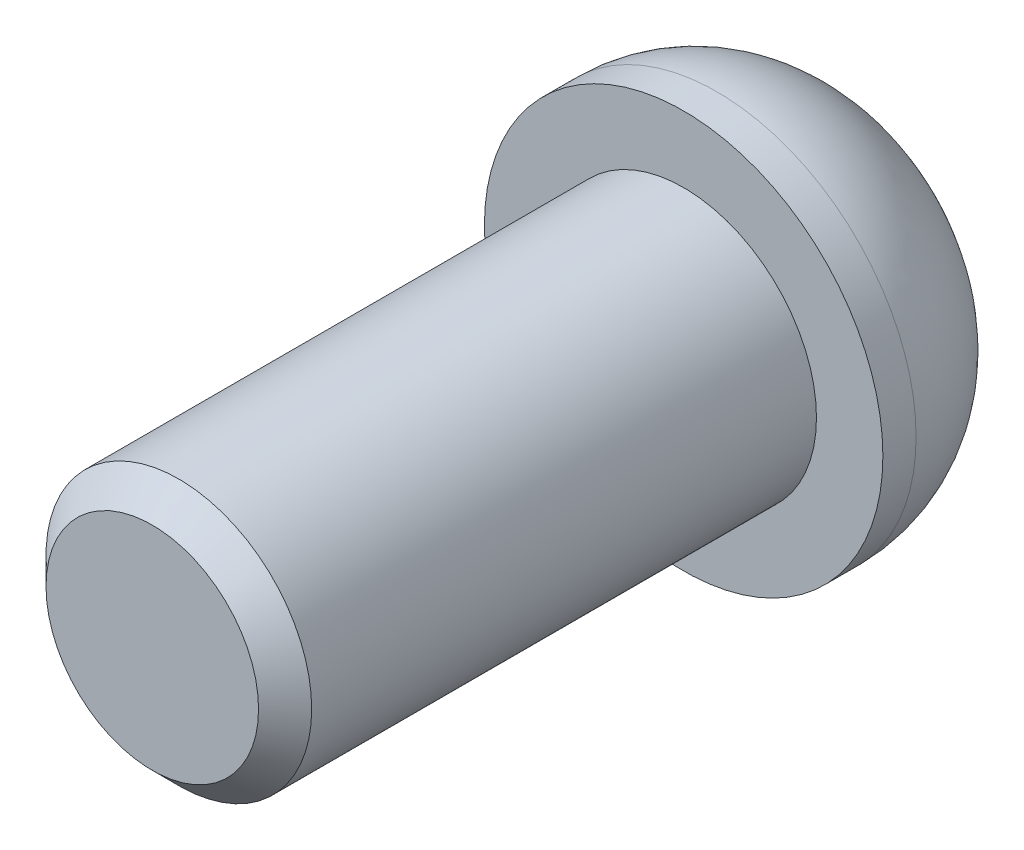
ISO-10303-21;
HEADER;
FILE_DESCRIPTION(('STEP AP214'),'2;1');
FILE_NAME('part.step','',(''),(''),'','','');
FILE_SCHEMA(('AUTOMOTIVE_DESIGN { 1 0 10303 214 1 1 1 1 }'));
ENDSEC;
DATA;
#1=APPLICATION_CONTEXT('core data for automotive mechanical design processes');
#2=APPLICATION_PROTOCOL_DEFINITION('international standard','automotive_design',2000,#1);
#3=PRODUCT_CONTEXT('',#1,'mechanical');
#4=PRODUCT('Part','Part','',(#3));
#5=PRODUCT_RELATED_PRODUCT_CATEGORY('part','',(#4));
#6=PRODUCT_DEFINITION_FORMATION('','',#4);
#7=PRODUCT_DEFINITION_CONTEXT('part definition',#1,'design');
#8=PRODUCT_DEFINITION('design','',#6,#7);
#9=PRODUCT_DEFINITION_SHAPE('','',#8);
#10=(LENGTH_UNIT() NAMED_UNIT(*) SI_UNIT(.MILLI.,.METRE.));
#11=(NAMED_UNIT(*) PLANE_ANGLE_UNIT() SI_UNIT($,.RADIAN.));
#12=(NAMED_UNIT(*) SI_UNIT($,.STERADIAN.) SOLID_ANGLE_UNIT());
#13=UNCERTAINTY_MEASURE_WITH_UNIT(LENGTH_MEASURE(1.E-05),#10,'distance_accuracy_value','');
#14=(GEOMETRIC_REPRESENTATION_CONTEXT(3) GLOBAL_UNCERTAINTY_ASSIGNED_CONTEXT((#13)) GLOBAL_UNIT_ASSIGNED_CONTEXT((#10,
#11,#12)) REPRESENTATION_CONTEXT('',''));
#15=CARTESIAN_POINT('',(0.,0.,0.));
#16=DIRECTION('',(0.,0.,1.));
#17=DIRECTION('',(1.,0.,0.));
#18=AXIS2_PLACEMENT_3D('',#15,#16,#17);
#19=CARTESIAN_POINT('',(0.,0.,-1.));
#20=DIRECTION('',(0.,0.,-1.));
#21=DIRECTION('',(-1.,0.,0.));
#22=AXIS2_PLACEMENT_3D('',#19,#20,#21);
#23=DEGENERATE_TOROIDAL_SURFACE('',#22,1.5,4.5,.T.);
#24=CARTESIAN_POINT('',(0.,0.,-1.));
#25=DIRECTION('',(0.,0.,-1.));
#26=DIRECTION('',(-1.,0.,0.));
#27=AXIS2_PLACEMENT_3D('',#24,#25,#26);
#28=CIRCLE('',#27,6.);
#29=CARTESIAN_POINT('',(-6.,0.,-1.));
#30=VERTEX_POINT('',#29);
#31=EDGE_CURVE('E104',#30,#30,#28,.T.);
#32=ORIENTED_EDGE('',*,*,#31,.T.);
#33=EDGE_LOOP('',(#32));
#34=FACE_BOUND('',#33,.T.);
#35=CARTESIAN_POINT('',(-3.,0.,-5.24264068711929));
#36=CARTESIAN_POINT('',(-3.,0.106235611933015,-5.24263949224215));
#37=CARTESIAN_POINT('',(-3.,0.212466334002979,-5.24065218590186));
#38=CARTESIAN_POINT('',(-3.,0.424775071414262,-5.23262299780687));
#39=CARTESIAN_POINT('',(-3.,0.530853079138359,-5.22658092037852));
#40=CARTESIAN_POINT('',(-3.,0.848689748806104,-5.20207775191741));
#41=CARTESIAN_POINT('',(-3.,1.06001518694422,-5.17723961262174));
#42=CARTESIAN_POINT('',(-3.,1.47852757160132,-5.10800809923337));
#43=CARTESIAN_POINT('',(-3.,1.68572886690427,-5.06370327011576));
#44=CARTESIAN_POINT('',(-3.,2.09397220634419,-4.95262336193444));
#45=CARTESIAN_POINT('',(-3.,2.29502078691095,-4.88587310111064));
#46=CARTESIAN_POINT('',(-3.,2.60616926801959,-4.76060307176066));
#47=CARTESIAN_POINT('',(-3.,2.71952529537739,-4.71007776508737));
#48=CARTESIAN_POINT('',(-3.,2.94201444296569,-4.60043007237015));
#49=CARTESIAN_POINT('',(-3.,3.05114801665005,-4.54130861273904));
#50=CARTESIAN_POINT('',(-3.,3.26430134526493,-4.41442738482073));
#51=CARTESIAN_POINT('',(-3.,3.36832042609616,-4.3466664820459));
#52=CARTESIAN_POINT('',(-3.,3.57031812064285,-4.20265018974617));
#53=CARTESIAN_POINT('',(-3.,3.66829662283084,-4.12639464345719));
#54=CARTESIAN_POINT('',(-3.,3.85774604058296,-3.9653126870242));
#55=CARTESIAN_POINT('',(-3.,3.94918406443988,-3.88044752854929));
#56=CARTESIAN_POINT('',(-3.,4.12418125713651,-3.70287619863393));
#57=CARTESIAN_POINT('',(-3.,4.2077374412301,-3.61016708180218));
#58=CARTESIAN_POINT('',(-3.,4.36606006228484,-3.41757723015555));
#59=CARTESIAN_POINT('',(-3.,4.44082980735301,-3.31769921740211));
#60=CARTESIAN_POINT('',(-3.,4.5808709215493,-3.11143338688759));
#61=CARTESIAN_POINT('',(-3.,4.64613902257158,-3.00504334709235));
#62=CARTESIAN_POINT('',(-3.,4.76237670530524,-2.79404402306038));
#63=CARTESIAN_POINT('',(-3.,4.81401568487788,-2.68980302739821));
#64=CARTESIAN_POINT('',(-3.,4.90795864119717,-2.47714833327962));
#65=CARTESIAN_POINT('',(-3.,4.95025923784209,-2.36873314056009));
#66=CARTESIAN_POINT('',(-3.,5.02507846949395,-2.14864951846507));
#67=CARTESIAN_POINT('',(-3.,5.05760363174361,-2.03698331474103));
#68=CARTESIAN_POINT('',(-3.,5.11261717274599,-1.81119389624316));
#69=CARTESIAN_POINT('',(-3.,5.13510193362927,-1.69706981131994));
#70=CARTESIAN_POINT('',(-3.,5.1855293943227,-1.36286611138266));
#71=CARTESIAN_POINT('',(-3.,5.1999223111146,-1.14057767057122));
#72=CARTESIAN_POINT('',(-3.,5.19068849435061,-0.696926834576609));
#73=CARTESIAN_POINT('',(-3.,5.16706539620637,-0.475564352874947));
#74=CARTESIAN_POINT('',(-3.,5.08315277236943,-0.0425431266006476));
#75=CARTESIAN_POINT('',(-3.,5.02328901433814,0.169198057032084));
#76=CARTESIAN_POINT('',(-3.,4.86926580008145,0.57976055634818));
#77=CARTESIAN_POINT('',(-3.,4.7751091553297,0.778582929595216));
#78=CARTESIAN_POINT('',(-3.,4.55430118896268,1.16039899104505));
#79=CARTESIAN_POINT('',(-3.,4.42727866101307,1.34317762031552));
#80=CARTESIAN_POINT('',(-3.,4.14543120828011,1.68588944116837));
#81=CARTESIAN_POINT('',(-3.,3.99059590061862,1.8458140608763));
#82=CARTESIAN_POINT('',(-3.,3.65104925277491,2.14580620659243));
#83=CARTESIAN_POINT('',(-3.,3.46535730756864,2.2847597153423));
#84=CARTESIAN_POINT('',(-3.,3.0751909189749,2.53254712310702));
#85=CARTESIAN_POINT('',(-3.,2.87073222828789,2.64140598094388));
#86=CARTESIAN_POINT('',(-3.,2.51303879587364,2.80083705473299));
#87=CARTESIAN_POINT('',(-3.,2.36312749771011,2.85906808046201));
#88=CARTESIAN_POINT('',(-3.,2.05866247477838,2.96191606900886));
#89=CARTESIAN_POINT('',(-3.,1.90410728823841,3.00652869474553));
#90=CARTESIAN_POINT('',(-3.,1.59113761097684,3.08335556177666));
#91=CARTESIAN_POINT('',(-3.,1.43270714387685,3.11550362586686));
#92=CARTESIAN_POINT('',(-3.,1.1139659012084,3.16839749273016));
#93=CARTESIAN_POINT('',(-3.,0.953654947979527,3.18914220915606));
#94=CARTESIAN_POINT('',(-3.,0.68108593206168,3.21569206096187));
#95=CARTESIAN_POINT('',(-3.,0.569070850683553,3.22412335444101));
#96=CARTESIAN_POINT('',(-3.,0.344778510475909,3.23637578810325));
#97=CARTESIAN_POINT('',(-3.,0.23250123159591,3.24019656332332));
#98=CARTESIAN_POINT('',(-3.,0.00781434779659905,3.2433824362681));
#99=CARTESIAN_POINT('',(-3.,-0.104595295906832,3.24274471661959));
#100=CARTESIAN_POINT('',(-3.,-0.329298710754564,3.23698082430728));
#101=CARTESIAN_POINT('',(-3.,-0.441592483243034,3.23185470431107));
#102=CARTESIAN_POINT('',(-3.,-0.66547675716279,3.21693634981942));
#103=CARTESIAN_POINT('',(-3.,-0.777068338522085,3.20716081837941));
#104=CARTESIAN_POINT('',(-3.,-0.999700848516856,3.18261749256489));
#105=CARTESIAN_POINT('',(-3.,-1.11074170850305,3.16784909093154));
#106=CARTESIAN_POINT('',(-3.,-1.44236615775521,3.11544322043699));
#107=CARTESIAN_POINT('',(-3.,-1.66179295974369,3.06968493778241));
#108=CARTESIAN_POINT('',(-3.,-2.00610733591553,2.97682275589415));
#109=CARTESIAN_POINT('',(-3.,-2.13321212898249,2.93780607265));
#110=CARTESIAN_POINT('',(-3.,-2.38414729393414,2.85039235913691));
#111=CARTESIAN_POINT('',(-3.,-2.50797865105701,2.80199818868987));
#112=CARTESIAN_POINT('',(-3.,-2.75125299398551,2.69551015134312));
#113=CARTESIAN_POINT('',(-3.,-2.87070059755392,2.63742687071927));
#114=CARTESIAN_POINT('',(-3.,-3.10427715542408,2.51136880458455));
#115=CARTESIAN_POINT('',(-3.,-3.21840607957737,2.44339396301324));
#116=CARTESIAN_POINT('',(-3.,-3.44110072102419,2.29704687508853));
#117=CARTESIAN_POINT('',(-3.,-3.54961548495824,2.21859688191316));
#118=CARTESIAN_POINT('',(-3.,-3.75894467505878,2.05202253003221));
#119=CARTESIAN_POINT('',(-3.,-3.8597598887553,1.96389916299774));
#120=CARTESIAN_POINT('',(-3.,-4.05263576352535,1.77842866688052));
#121=CARTESIAN_POINT('',(-3.,-4.1446915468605,1.68107645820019));
#122=CARTESIAN_POINT('',(-3.,-4.31891815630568,1.47789786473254));
#123=CARTESIAN_POINT('',(-3.,-4.40109010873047,1.3720724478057));
#124=CARTESIAN_POINT('',(-3.,-4.54643438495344,1.16446650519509));
#125=CARTESIAN_POINT('',(-3.,-4.61069753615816,1.06344804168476));
#126=CARTESIAN_POINT('',(-3.,-4.72996144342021,0.856033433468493));
#127=CARTESIAN_POINT('',(-3.,-4.78495913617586,0.749635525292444));
#128=CARTESIAN_POINT('',(-3.,-4.88507638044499,0.532403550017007));
#129=CARTESIAN_POINT('',(-3.,-4.93020545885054,0.421573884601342));
#130=CARTESIAN_POINT('',(-3.,-5.01022120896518,0.196265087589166));
#131=CARTESIAN_POINT('',(-3.,-5.04510424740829,0.0817846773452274));
#132=CARTESIAN_POINT('',(-3.,-5.13001100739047,-0.250893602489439));
#133=CARTESIAN_POINT('',(-3.,-5.16678689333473,-0.472639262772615));
#134=CARTESIAN_POINT('',(-3.,-5.20174368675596,-0.91902341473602));
#135=CARTESIAN_POINT('',(-3.,-5.1999290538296,-1.14366156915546));
#136=CARTESIAN_POINT('',(-3.,-5.15825140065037,-1.58495021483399));
#137=CARTESIAN_POINT('',(-3.,-5.11913344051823,-1.80167099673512));
#138=CARTESIAN_POINT('',(-3.,-5.00524104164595,-2.22549681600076));
#139=CARTESIAN_POINT('',(-3.,-4.93046840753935,-2.43260233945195));
#140=CARTESIAN_POINT('',(-3.,-4.74728289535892,-2.83264502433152));
#141=CARTESIAN_POINT('',(-3.,-4.63869596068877,-3.02550233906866));
#142=CARTESIAN_POINT('',(-3.,-4.39160310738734,-3.39093989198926));
#143=CARTESIAN_POINT('',(-3.,-4.25309491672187,-3.56351858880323));
#144=CARTESIAN_POINT('',(-3.,-3.94582464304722,-3.88962572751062));
#145=CARTESIAN_POINT('',(-3.,-3.77624930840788,-4.04238605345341));
#146=CARTESIAN_POINT('',(-3.,-3.41546125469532,-4.31960240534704));
#147=CARTESIAN_POINT('',(-3.,-3.22424507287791,-4.44405389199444));
#148=CARTESIAN_POINT('',(-3.,-2.81019497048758,-4.67239316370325));
#149=CARTESIAN_POINT('',(-3.,-2.58605749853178,-4.77390276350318));
#150=CARTESIAN_POINT('',(-3.,-2.12599927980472,-4.94433820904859));
#151=CARTESIAN_POINT('',(-3.,-1.89007882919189,-5.01326487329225));
#152=CARTESIAN_POINT('',(-3.,-1.3810647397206,-5.12939698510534));
#153=CARTESIAN_POINT('',(-3.,-1.10709195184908,-5.17266971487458));
#154=CARTESIAN_POINT('',(-3.,-0.693632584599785,-5.21508446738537));
#155=CARTESIAN_POINT('',(-3.,-0.555119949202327,-5.2254717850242));
#156=CARTESIAN_POINT('',(-3.,-0.27773540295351,-5.23925037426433));
#157=CARTESIAN_POINT('',(-3.,-0.138863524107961,-5.24264224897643));
#158=CARTESIAN_POINT('',(-3.,0.,-5.24264068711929));
#159=B_SPLINE_CURVE_WITH_KNOTS('',3,(#35,#36,#37,#38,#39,#40,#41,#42,#43,#44,#45,#46,#47,#48,
#49,#50,#51,#52,#53,#54,#55,#56,#57,#58,#59,#60,#61,#62,#63,#64,#65,#66,#67,#68,#69,#70,#71,#72,
#73,#74,#75,#76,#77,#78,#79,#80,#81,#82,#83,#84,#85,#86,#87,#88,#89,#90,#91,#92,#93,#94,#95,#96,
#97,#98,#99,#100,#101,#102,#103,#104,#105,#106,#107,#108,#109,#110,#111,#112,#113,#114,#115,
#116,#117,#118,#119,#120,#121,#122,#123,#124,#125,#126,#127,#128,#129,#130,#131,#132,#133,#134,
#135,#136,#137,#138,#139,#140,#141,#142,#143,#144,#145,#146,#147,#148,#149,#150,#151,#152,#153,
#154,#155,#156,#157,#158),.UNSPECIFIED.,.T.,.F.,(4,2,2,2,2,2,2,2,2,2,2,2,2,2,2,2,2,2,2,2,2,2,2,
2,2,2,2,2,2,2,2,2,2,2,2,2,2,2,2,2,2,2,2,2,2,2,2,2,2,2,2,2,2,2,2,2,2,2,2,2,2,4),(0.,
0.318674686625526,0.637364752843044,1.2748522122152,1.90946957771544,2.54338753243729,
2.91538752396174,3.28734745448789,3.65935627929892,4.03137197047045,4.4051432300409,
4.7790554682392,5.15282647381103,5.52672573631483,5.87527563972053,6.22395149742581,
6.57239401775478,6.92096199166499,7.58571138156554,8.25039720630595,8.90742164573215,
9.56439223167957,10.2291341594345,10.8941247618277,11.5870032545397,12.2793053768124,
12.7611450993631,13.2431381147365,13.727656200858,14.2122204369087,14.5491272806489,
14.8860607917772,15.2232072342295,15.5603497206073,15.8962900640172,16.2322712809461,
16.9032115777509,17.3017800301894,17.7002271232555,18.0982416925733,18.4962585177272,
18.8974132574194,19.2985269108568,19.6998626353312,20.1011525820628,20.4598672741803,
20.8187003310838,21.1771854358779,21.535797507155,22.2065378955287,22.8772007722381,
23.5347430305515,24.1922520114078,24.853203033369,25.514204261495,26.1959561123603,
26.8778172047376,27.6131539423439,28.3484722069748,29.1783423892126,29.5949268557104,
30.0114754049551),.UNSPECIFIED.);
#160=CARTESIAN_POINT('',(-3.,-1.73205080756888,-5.04874114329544));
#161=VERTEX_POINT('',#160);
#162=CARTESIAN_POINT('',(-3.,1.73205080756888,-5.04874114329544));
#163=VERTEX_POINT('',#162);
#164=EDGE_CURVE('E177',#161,#163,#159,.T.);
#165=ORIENTED_EDGE('',*,*,#164,.F.);
#166=CARTESIAN_POINT('',(0.000199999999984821,-3.4642170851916,-5.04868512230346));
#167=CARTESIAN_POINT('',(-0.0880572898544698,-3.41326171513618,-5.07340804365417));
#168=CARTESIAN_POINT('',(-0.176855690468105,-3.36199393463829,-5.09545850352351));
#169=CARTESIAN_POINT('',(-0.355238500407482,-3.25900457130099,-5.1345672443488));
#170=CARTESIAN_POINT('',(-0.444822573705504,-3.20728318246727,-5.15162756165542));
#171=CARTESIAN_POINT('',(-0.624544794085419,-3.10352051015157,-5.18112701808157));
#172=CARTESIAN_POINT('',(-0.71468288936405,-3.05147925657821,-5.19356658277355));
#173=CARTESIAN_POINT('',(-0.89532970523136,-2.94718276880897,-5.21415032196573));
#174=CARTESIAN_POINT('',(-0.985838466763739,-2.89492751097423,-5.22229400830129));
#175=CARTESIAN_POINT('',(-1.25438139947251,-2.73988417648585,-5.24047876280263));
#176=CARTESIAN_POINT('',(-1.43272157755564,-2.63691942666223,-5.24478751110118));
#177=CARTESIAN_POINT('',(-1.78918301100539,-2.4311163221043,-5.23855836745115));
#178=CARTESIAN_POINT('',(-1.96730430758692,-2.32827794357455,-5.2280239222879));
#179=CARTESIAN_POINT('',(-2.21649805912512,-2.18440586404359,-5.20181563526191));
#180=CARTESIAN_POINT('',(-2.28812943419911,-2.1430494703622,-5.19294194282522));
#181=CARTESIAN_POINT('',(-2.43106610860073,-2.06052494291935,-5.17236840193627));
#182=CARTESIAN_POINT('',(-2.50237151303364,-2.01935674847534,-5.16066954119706));
#183=CARTESIAN_POINT('',(-2.64508448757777,-1.93696137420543,-5.1341775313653));
#184=CARTESIAN_POINT('',(-2.71648902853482,-1.89573594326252,-5.11936249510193));
#185=CARTESIAN_POINT('',(-2.85877926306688,-1.81358463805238,-5.08649691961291));
#186=CARTESIAN_POINT('',(-2.92966463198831,-1.77265895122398,-5.06844451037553));
#187=CARTESIAN_POINT('',(-3.0002,-1.73193533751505,-5.04868512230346));
#188=B_SPLINE_CURVE_WITH_KNOTS('',3,(#166,#167,#168,#169,#170,#171,#172,#173,#174,#175,#176,
#177,#178,#179,#180,#181,#182,#183,#184,#185,#186,#187),.UNSPECIFIED.,.F.,.F.,(4,2,2,2,2,2,2,2,
2,2,4),(0.,0.314530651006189,0.628932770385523,0.943305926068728,1.2577147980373,
1.87506574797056,2.49227336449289,2.74179737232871,2.99123426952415,3.24248542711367,
3.49388218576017),.UNSPECIFIED.);
#189=CARTESIAN_POINT('',(0.,-3.46410161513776,-5.04874114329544));
#190=VERTEX_POINT('',#189);
#191=EDGE_CURVE('E141',#190,#161,#188,.T.);
#192=ORIENTED_EDGE('',*,*,#191,.F.);
#193=CARTESIAN_POINT('',(3.0002,-1.73193533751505,-5.04868512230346));
#194=CARTESIAN_POINT('',(2.91194271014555,-1.78289070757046,-5.07340804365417));
#195=CARTESIAN_POINT('',(2.82314430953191,-1.83415848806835,-5.09545850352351));
#196=CARTESIAN_POINT('',(2.64476149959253,-1.93714785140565,-5.1345672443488));
#197=CARTESIAN_POINT('',(2.55517742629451,-1.98886924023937,-5.15162756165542));
#198=CARTESIAN_POINT('',(2.3754552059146,-2.09263191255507,-5.18112701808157));
#199=CARTESIAN_POINT('',(2.28531711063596,-2.14467316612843,-5.19356658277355));
#200=CARTESIAN_POINT('',(2.10467029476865,-2.24896965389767,-5.21415032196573));
#201=CARTESIAN_POINT('',(2.01416153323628,-2.30122491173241,-5.22229400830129));
#202=CARTESIAN_POINT('',(1.74561860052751,-2.45626824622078,-5.24047876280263));
#203=CARTESIAN_POINT('',(1.56727842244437,-2.55923299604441,-5.24478751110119));
#204=CARTESIAN_POINT('',(1.21081698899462,-2.76503610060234,-5.23855836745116));
#205=CARTESIAN_POINT('',(1.03269569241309,-2.86787447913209,-5.2280239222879));
#206=CARTESIAN_POINT('',(0.783501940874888,-3.01174655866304,-5.20181563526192));
#207=CARTESIAN_POINT('',(0.711870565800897,-3.05310295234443,-5.19294194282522));
#208=CARTESIAN_POINT('',(0.568933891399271,-3.13562747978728,-5.17236840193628));
#209=CARTESIAN_POINT('',(0.497628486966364,-3.1767956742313,-5.16066954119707));
#210=CARTESIAN_POINT('',(0.354915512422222,-3.25919104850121,-5.13417753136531));
#211=CARTESIAN_POINT('',(0.283510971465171,-3.30041647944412,-5.11936249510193));
#212=CARTESIAN_POINT('',(0.141220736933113,-3.38256778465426,-5.08649691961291));
#213=CARTESIAN_POINT('',(0.0703353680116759,-3.42349347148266,-5.06844451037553));
#214=CARTESIAN_POINT('',(-0.000200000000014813,-3.4642170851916,-5.04868512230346));
#215=B_SPLINE_CURVE_WITH_KNOTS('',3,(#193,#194,#195,#196,#197,#198,#199,#200,#201,#202,#203,
#204,#205,#206,#207,#208,#209,#210,#211,#212,#213,#214),.UNSPECIFIED.,.F.,.F.,(4,2,2,2,2,2,2,2,
2,2,4),(0.,0.314530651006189,0.628932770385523,0.943305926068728,1.2577147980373,
1.87506574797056,2.49227336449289,2.74179737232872,2.99123426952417,3.24248542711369,
3.4938821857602),.UNSPECIFIED.);
#216=CARTESIAN_POINT('',(3.,-1.73205080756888,-5.04874114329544));
#217=VERTEX_POINT('',#216);
#218=EDGE_CURVE('E117',#217,#190,#215,.T.);
#219=ORIENTED_EDGE('',*,*,#218,.F.);
#220=CARTESIAN_POINT('',(3.,0.,-5.24264068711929));
#221=CARTESIAN_POINT('',(3.,-0.106235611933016,-5.24263949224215));
#222=CARTESIAN_POINT('',(3.,-0.21246633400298,-5.24065218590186));
#223=CARTESIAN_POINT('',(3.,-0.424775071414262,-5.23262299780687));
#224=CARTESIAN_POINT('',(3.,-0.53085307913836,-5.22658092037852));
#225=CARTESIAN_POINT('',(3.,-0.848689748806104,-5.20207775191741));
#226=CARTESIAN_POINT('',(3.,-1.06001518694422,-5.17723961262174));
#227=CARTESIAN_POINT('',(3.,-1.47852757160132,-5.10800809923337));
#228=CARTESIAN_POINT('',(3.,-1.68572886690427,-5.06370327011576));
#229=CARTESIAN_POINT('',(3.,-2.09397220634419,-4.95262336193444));
#230=CARTESIAN_POINT('',(3.,-2.29502078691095,-4.88587310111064));
#231=CARTESIAN_POINT('',(3.,-2.60616926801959,-4.76060307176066));
#232=CARTESIAN_POINT('',(3.,-2.71952529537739,-4.71007776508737));
#233=CARTESIAN_POINT('',(3.,-2.94201444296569,-4.60043007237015));
#234=CARTESIAN_POINT('',(3.,-3.05114801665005,-4.54130861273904));
#235=CARTESIAN_POINT('',(3.,-3.26430134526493,-4.41442738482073));
#236=CARTESIAN_POINT('',(3.,-3.36832042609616,-4.3466664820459));
#237=CARTESIAN_POINT('',(3.,-3.57031812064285,-4.20265018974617));
#238=CARTESIAN_POINT('',(3.,-3.66829662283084,-4.12639464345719));
#239=CARTESIAN_POINT('',(3.,-3.85774604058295,-3.9653126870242));
#240=CARTESIAN_POINT('',(3.,-3.94918406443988,-3.88044752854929));
#241=CARTESIAN_POINT('',(3.,-4.12418125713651,-3.70287619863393));
#242=CARTESIAN_POINT('',(3.,-4.2077374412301,-3.61016708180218));
#243=CARTESIAN_POINT('',(3.,-4.36606006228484,-3.41757723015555));
#244=CARTESIAN_POINT('',(3.,-4.44082980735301,-3.31769921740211));
#245=CARTESIAN_POINT('',(3.,-4.5808709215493,-3.11143338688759));
#246=CARTESIAN_POINT('',(3.,-4.64613902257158,-3.00504334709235));
#247=CARTESIAN_POINT('',(3.,-4.76237670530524,-2.79404402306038));
#248=CARTESIAN_POINT('',(3.,-4.81401568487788,-2.68980302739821));
#249=CARTESIAN_POINT('',(3.,-4.90795864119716,-2.47714833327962));
#250=CARTESIAN_POINT('',(3.,-4.95025923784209,-2.36873314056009));
#251=CARTESIAN_POINT('',(3.,-5.02507846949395,-2.14864951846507));
#252=CARTESIAN_POINT('',(3.,-5.05760363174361,-2.03698331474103));
#253=CARTESIAN_POINT('',(3.,-5.11261717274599,-1.81119389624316));
#254=CARTESIAN_POINT('',(3.,-5.13510193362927,-1.69706981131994));
#255=CARTESIAN_POINT('',(3.,-5.1855293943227,-1.36286611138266));
#256=CARTESIAN_POINT('',(3.,-5.1999223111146,-1.14057767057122));
#257=CARTESIAN_POINT('',(3.,-5.19068849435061,-0.696926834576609));
#258=CARTESIAN_POINT('',(3.,-5.16706539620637,-0.475564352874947));
#259=CARTESIAN_POINT('',(3.,-5.08315277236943,-0.0425431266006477));
#260=CARTESIAN_POINT('',(3.,-5.02328901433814,0.169198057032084));
#261=CARTESIAN_POINT('',(3.,-4.86926580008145,0.57976055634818));
#262=CARTESIAN_POINT('',(3.,-4.7751091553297,0.778582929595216));
#263=CARTESIAN_POINT('',(3.,-4.55430118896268,1.16039899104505));
#264=CARTESIAN_POINT('',(3.,-4.42727866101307,1.34317762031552));
#265=CARTESIAN_POINT('',(3.,-4.14543120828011,1.68588944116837));
#266=CARTESIAN_POINT('',(3.,-3.99059590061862,1.8458140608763));
#267=CARTESIAN_POINT('',(3.,-3.65104925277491,2.14580620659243));
#268=CARTESIAN_POINT('',(3.,-3.46535730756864,2.2847597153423));
#269=CARTESIAN_POINT('',(3.,-3.0751909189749,2.53254712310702));
#270=CARTESIAN_POINT('',(3.,-2.87073222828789,2.64140598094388));
#271=CARTESIAN_POINT('',(3.,-2.51303879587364,2.80083705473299));
#272=CARTESIAN_POINT('',(3.,-2.36312749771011,2.85906808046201));
#273=CARTESIAN_POINT('',(3.,-2.05866247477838,2.96191606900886));
#274=CARTESIAN_POINT('',(3.,-1.90410728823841,3.00652869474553));
#275=CARTESIAN_POINT('',(3.,-1.59113761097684,3.08335556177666));
#276=CARTESIAN_POINT('',(3.,-1.43270714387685,3.11550362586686));
#277=CARTESIAN_POINT('',(3.,-1.1139659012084,3.16839749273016));
#278=CARTESIAN_POINT('',(3.,-0.953654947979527,3.18914220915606));
#279=CARTESIAN_POINT('',(3.,-0.681085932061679,3.21569206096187));
#280=CARTESIAN_POINT('',(3.,-0.569070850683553,3.22412335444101));
#281=CARTESIAN_POINT('',(3.,-0.344778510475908,3.23637578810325));
#282=CARTESIAN_POINT('',(3.,-0.232501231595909,3.24019656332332));
#283=CARTESIAN_POINT('',(3.,-0.00781434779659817,3.2433824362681));
#284=CARTESIAN_POINT('',(3.,0.104595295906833,3.24274471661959));
#285=CARTESIAN_POINT('',(3.,0.329298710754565,3.23698082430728));
#286=CARTESIAN_POINT('',(3.,0.441592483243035,3.23185470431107));
#287=CARTESIAN_POINT('',(3.,0.665476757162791,3.21693634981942));
#288=CARTESIAN_POINT('',(3.,0.777068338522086,3.20716081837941));
#289=CARTESIAN_POINT('',(3.,0.999700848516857,3.18261749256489));
#290=CARTESIAN_POINT('',(3.,1.11074170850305,3.16784909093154));
#291=CARTESIAN_POINT('',(3.,1.44236615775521,3.11544322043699));
#292=CARTESIAN_POINT('',(3.,1.66179295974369,3.06968493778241));
#293=CARTESIAN_POINT('',(3.,2.00610733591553,2.97682275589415));
#294=CARTESIAN_POINT('',(3.,2.13321212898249,2.93780607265));
#295=CARTESIAN_POINT('',(3.,2.38414729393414,2.85039235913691));
#296=CARTESIAN_POINT('',(3.,2.50797865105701,2.80199818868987));
#297=CARTESIAN_POINT('',(3.,2.75125299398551,2.69551015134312));
#298=CARTESIAN_POINT('',(3.,2.87070059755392,2.63742687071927));
#299=CARTESIAN_POINT('',(3.,3.10427715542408,2.51136880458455));
#300=CARTESIAN_POINT('',(3.,3.21840607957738,2.44339396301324));
#301=CARTESIAN_POINT('',(3.,3.44110072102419,2.29704687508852));
#302=CARTESIAN_POINT('',(3.,3.54961548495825,2.21859688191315));
#303=CARTESIAN_POINT('',(3.,3.75894467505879,2.0520225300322));
#304=CARTESIAN_POINT('',(3.,3.8597598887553,1.96389916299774));
#305=CARTESIAN_POINT('',(3.,4.05263576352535,1.77842866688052));
#306=CARTESIAN_POINT('',(3.,4.14469154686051,1.68107645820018));
#307=CARTESIAN_POINT('',(3.,4.31891815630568,1.47789786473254));
#308=CARTESIAN_POINT('',(3.,4.40109010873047,1.3720724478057));
#309=CARTESIAN_POINT('',(3.,4.54643438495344,1.16446650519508));
#310=CARTESIAN_POINT('',(3.,4.61069753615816,1.06344804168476));
#311=CARTESIAN_POINT('',(3.,4.72996144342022,0.856033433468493));
#312=CARTESIAN_POINT('',(3.,4.78495913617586,0.749635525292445));
#313=CARTESIAN_POINT('',(3.,4.88507638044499,0.532403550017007));
#314=CARTESIAN_POINT('',(3.,4.93020545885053,0.421573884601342));
#315=CARTESIAN_POINT('',(3.,5.01022120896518,0.196265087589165));
#316=CARTESIAN_POINT('',(3.,5.04510424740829,0.0817846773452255));
#317=CARTESIAN_POINT('',(3.,5.13001100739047,-0.25089360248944));
#318=CARTESIAN_POINT('',(3.,5.16678689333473,-0.472639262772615));
#319=CARTESIAN_POINT('',(3.,5.20174368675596,-0.91902341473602));
#320=CARTESIAN_POINT('',(3.,5.1999290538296,-1.14366156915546));
#321=CARTESIAN_POINT('',(3.,5.15825140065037,-1.58495021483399));
#322=CARTESIAN_POINT('',(3.,5.11913344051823,-1.80167099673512));
#323=CARTESIAN_POINT('',(3.,5.00524104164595,-2.22549681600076));
#324=CARTESIAN_POINT('',(3.,4.93046840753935,-2.43260233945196));
#325=CARTESIAN_POINT('',(3.,4.74728289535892,-2.83264502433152));
#326=CARTESIAN_POINT('',(3.,4.63869596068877,-3.02550233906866));
#327=CARTESIAN_POINT('',(3.,4.39160310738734,-3.39093989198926));
#328=CARTESIAN_POINT('',(3.,4.25309491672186,-3.56351858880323));
#329=CARTESIAN_POINT('',(3.,3.94582464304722,-3.88962572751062));
#330=CARTESIAN_POINT('',(3.,3.77624930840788,-4.04238605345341));
#331=CARTESIAN_POINT('',(3.,3.41546125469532,-4.31960240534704));
#332=CARTESIAN_POINT('',(3.,3.22424507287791,-4.44405389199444));
#333=CARTESIAN_POINT('',(3.,2.81019497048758,-4.67239316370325));
#334=CARTESIAN_POINT('',(3.,2.58605749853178,-4.77390276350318));
#335=CARTESIAN_POINT('',(3.,2.12599927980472,-4.94433820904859));
#336=CARTESIAN_POINT('',(3.,1.89007882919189,-5.01326487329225));
#337=CARTESIAN_POINT('',(3.,1.3810647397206,-5.12939698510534));
#338=CARTESIAN_POINT('',(3.,1.10709195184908,-5.17266971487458));
#339=CARTESIAN_POINT('',(3.,0.693632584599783,-5.21508446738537));
#340=CARTESIAN_POINT('',(3.,0.555119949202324,-5.22547178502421));
#341=CARTESIAN_POINT('',(3.,0.277735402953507,-5.23925037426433));
#342=CARTESIAN_POINT('',(3.,0.138863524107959,-5.24264224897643));
#343=CARTESIAN_POINT('',(3.,0.,-5.24264068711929));
#344=B_SPLINE_CURVE_WITH_KNOTS('',3,(#220,#221,#222,#223,#224,#225,#226,#227,#228,#229,#230,
#231,#232,#233,#234,#235,#236,#237,#238,#239,#240,#241,#242,#243,#244,#245,#246,#247,#248,#249,
#250,#251,#252,#253,#254,#255,#256,#257,#258,#259,#260,#261,#262,#263,#264,#265,#266,#267,#268,
#269,#270,#271,#272,#273,#274,#275,#276,#277,#278,#279,#280,#281,#282,#283,#284,#285,#286,#287,
#288,#289,#290,#291,#292,#293,#294,#295,#296,#297,#298,#299,#300,#301,#302,#303,#304,#305,#306,
#307,#308,#309,#310,#311,#312,#313,#314,#315,#316,#317,#318,#319,#320,#321,#322,#323,#324,#325,
#326,#327,#328,#329,#330,#331,#332,#333,#334,#335,#336,#337,#338,#339,#340,#341,#342,#343),
.UNSPECIFIED.,.T.,.F.,(4,2,2,2,2,2,2,2,2,2,2,2,2,2,2,2,2,2,2,2,2,2,2,2,2,2,2,2,2,2,2,2,2,2,2,2,
2,2,2,2,2,2,2,2,2,2,2,2,2,2,2,2,2,2,2,2,2,2,2,2,2,4),(0.,0.318674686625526,0.637364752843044,
1.2748522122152,1.90946957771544,2.54338753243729,2.91538752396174,3.28734745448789,
3.65935627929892,4.03137197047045,4.4051432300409,4.7790554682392,5.15282647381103,
5.52672573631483,5.87527563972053,6.22395149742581,6.57239401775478,6.92096199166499,
7.58571138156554,8.25039720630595,8.90742164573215,9.56439223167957,10.2291341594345,
10.8941247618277,11.5870032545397,12.2793053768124,12.7611450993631,13.2431381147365,
13.727656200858,14.2122204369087,14.5491272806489,14.8860607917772,15.2232072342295,
15.5603497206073,15.8962900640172,16.2322712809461,16.9032115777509,17.3017800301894,
17.7002271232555,18.0982416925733,18.4962585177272,18.8974132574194,19.2985269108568,
19.6998626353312,20.1011525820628,20.4598672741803,20.8187003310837,21.1771854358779,
21.535797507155,22.2065378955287,22.8772007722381,23.5347430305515,24.1922520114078,
24.853203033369,25.514204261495,26.1959561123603,26.8778172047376,27.6131539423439,
28.3484722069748,29.1783423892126,29.5949268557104,30.0114754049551),.UNSPECIFIED.);
#345=CARTESIAN_POINT('',(3.,1.73205080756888,-5.04874114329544));
#346=VERTEX_POINT('',#345);
#347=EDGE_CURVE('E112',#346,#217,#344,.T.);
#348=ORIENTED_EDGE('',*,*,#347,.F.);
#349=CARTESIAN_POINT('',(-0.000200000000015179,3.4642170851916,-5.04868512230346));
#350=CARTESIAN_POINT('',(0.0880572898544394,3.41326171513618,-5.07340804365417));
#351=CARTESIAN_POINT('',(0.176855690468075,3.36199393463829,-5.09545850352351));
#352=CARTESIAN_POINT('',(0.355238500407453,3.25900457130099,-5.1345672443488));
#353=CARTESIAN_POINT('',(0.444822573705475,3.20728318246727,-5.15162756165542));
#354=CARTESIAN_POINT('',(0.62454479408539,3.10352051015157,-5.18112701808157));
#355=CARTESIAN_POINT('',(0.714682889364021,3.05147925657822,-5.19356658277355));
#356=CARTESIAN_POINT('',(0.895329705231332,2.94718276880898,-5.21415032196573));
#357=CARTESIAN_POINT('',(0.985838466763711,2.89492751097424,-5.22229400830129));
#358=CARTESIAN_POINT('',(1.25438139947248,2.73988417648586,-5.24047876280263));
#359=CARTESIAN_POINT('',(1.43272157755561,2.63691942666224,-5.24478751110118));
#360=CARTESIAN_POINT('',(1.78918301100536,2.4311163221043,-5.23855836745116));
#361=CARTESIAN_POINT('',(1.96730430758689,2.32827794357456,-5.2280239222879));
#362=CARTESIAN_POINT('',(2.2164980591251,2.1844058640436,-5.20181563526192));
#363=CARTESIAN_POINT('',(2.28812943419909,2.14304947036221,-5.19294194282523));
#364=CARTESIAN_POINT('',(2.43106610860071,2.06052494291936,-5.17236840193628));
#365=CARTESIAN_POINT('',(2.50237151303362,2.01935674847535,-5.16066954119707));
#366=CARTESIAN_POINT('',(2.64508448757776,1.93696137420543,-5.13417753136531));
#367=CARTESIAN_POINT('',(2.71648902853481,1.89573594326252,-5.11936249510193));
#368=CARTESIAN_POINT('',(2.85877926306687,1.81358463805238,-5.08649691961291));
#369=CARTESIAN_POINT('',(2.92966463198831,1.77265895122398,-5.06844451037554));
#370=CARTESIAN_POINT('',(3.0002,1.73193533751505,-5.04868512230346));
#371=B_SPLINE_CURVE_WITH_KNOTS('',3,(#349,#350,#351,#352,#353,#354,#355,#356,#357,#358,#359,
#360,#361,#362,#363,#364,#365,#366,#367,#368,#369,#370),.UNSPECIFIED.,.F.,.F.,(4,2,2,2,2,2,2,2,
2,2,4),(0.,0.314530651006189,0.628932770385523,0.943305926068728,1.2577147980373,
1.87506574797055,2.49227336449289,2.74179737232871,2.99123426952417,3.24248542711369,
3.4938821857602),.UNSPECIFIED.);
#372=CARTESIAN_POINT('',(0.,3.46410161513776,-5.04874114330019));
#373=VERTEX_POINT('',#372);
#374=EDGE_CURVE('E146',#373,#346,#371,.T.);
#375=ORIENTED_EDGE('',*,*,#374,.F.);
#376=CARTESIAN_POINT('',(-3.0002,1.73193533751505,-5.04868512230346));
#377=CARTESIAN_POINT('',(-2.91194271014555,1.78289070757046,-5.07340804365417));
#378=CARTESIAN_POINT('',(-2.82314430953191,1.83415848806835,-5.09545850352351));
#379=CARTESIAN_POINT('',(-2.64476149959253,1.93714785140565,-5.1345672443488));
#380=CARTESIAN_POINT('',(-2.55517742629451,1.98886924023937,-5.15162756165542));
#381=CARTESIAN_POINT('',(-2.3754552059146,2.09263191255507,-5.18112701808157));
#382=CARTESIAN_POINT('',(-2.28531711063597,2.14467316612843,-5.19356658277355));
#383=CARTESIAN_POINT('',(-2.10467029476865,2.24896965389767,-5.21415032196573));
#384=CARTESIAN_POINT('',(-2.01416153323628,2.30122491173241,-5.22229400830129));
#385=CARTESIAN_POINT('',(-1.74561860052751,2.45626824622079,-5.24047876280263));
#386=CARTESIAN_POINT('',(-1.56727842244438,2.55923299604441,-5.24478751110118));
#387=CARTESIAN_POINT('',(-1.21081698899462,2.76503610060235,-5.23855836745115));
#388=CARTESIAN_POINT('',(-1.0326956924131,2.8678744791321,-5.2280239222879));
#389=CARTESIAN_POINT('',(-0.783501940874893,3.01174655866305,-5.20181563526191));
#390=CARTESIAN_POINT('',(-0.711870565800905,3.05310295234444,-5.19294194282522));
#391=CARTESIAN_POINT('',(-0.568933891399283,3.13562747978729,-5.17236840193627));
#392=CARTESIAN_POINT('',(-0.497628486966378,3.1767956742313,-5.16066954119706));
#393=CARTESIAN_POINT('',(-0.35491551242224,3.25919104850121,-5.1341775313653));
#394=CARTESIAN_POINT('',(-0.283510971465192,3.30041647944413,-5.11936249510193));
#395=CARTESIAN_POINT('',(-0.141220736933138,3.38256778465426,-5.08649691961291));
#396=CARTESIAN_POINT('',(-0.0703353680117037,3.42349347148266,-5.06844451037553));
#397=CARTESIAN_POINT('',(0.000199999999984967,3.4642170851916,-5.04868512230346));
#398=B_SPLINE_CURVE_WITH_KNOTS('',3,(#376,#377,#378,#379,#380,#381,#382,#383,#384,#385,#386,
#387,#388,#389,#390,#391,#392,#393,#394,#395,#396,#397),.UNSPECIFIED.,.F.,.F.,(4,2,2,2,2,2,2,2,
2,2,4),(0.,0.314530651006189,0.628932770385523,0.943305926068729,1.2577147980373,
1.87506574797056,2.49227336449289,2.74179737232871,2.99123426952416,3.24248542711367,
3.49388218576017),.UNSPECIFIED.);
#399=EDGE_CURVE('E52',#163,#373,#398,.T.);
#400=ORIENTED_EDGE('',*,*,#399,.F.);
#401=EDGE_LOOP('',(#165,#192,#219,#348,#375,#400));
#402=FACE_BOUND('',#401,.T.);
#403=ADVANCED_FACE('F29',(#34,#402),#23,.T.);
#404=CARTESIAN_POINT('',(0.,0.,0.));
#405=DIRECTION('',(0.,0.,-1.));
#406=DIRECTION('',(-1.,0.,0.));
#407=AXIS2_PLACEMENT_3D('',#404,#405,#406);
#408=CYLINDRICAL_SURFACE('',#407,6.);
#409=ORIENTED_EDGE('',*,*,#31,.F.);
#410=EDGE_LOOP('',(#409));
#411=FACE_BOUND('',#410,.T.);
#412=CARTESIAN_POINT('',(0.,0.,0.));
#413=DIRECTION('',(0.,0.,-1.));
#414=DIRECTION('',(-1.,0.,0.));
#415=AXIS2_PLACEMENT_3D('',#412,#413,#414);
#416=CIRCLE('',#415,6.);
#417=CARTESIAN_POINT('',(-6.,0.,0.));
#418=VERTEX_POINT('',#417);
#419=EDGE_CURVE('E100',#418,#418,#416,.T.);
#420=ORIENTED_EDGE('',*,*,#419,.T.);
#421=EDGE_LOOP('',(#420));
#422=FACE_BOUND('',#421,.T.);
#423=ADVANCED_FACE('F162',(#411,#422),#408,.T.);
#424=CARTESIAN_POINT('',(0.,0.,0.));
#425=DIRECTION('',(0.,0.,-1.));
#426=DIRECTION('',(-1.,0.,0.));
#427=AXIS2_PLACEMENT_3D('',#424,#425,#426);
#428=PLANE('',#427);
#429=CARTESIAN_POINT('',(0.,0.,0.));
#430=DIRECTION('',(0.,0.,1.));
#431=DIRECTION('',(1.,0.,0.));
#432=AXIS2_PLACEMENT_3D('',#429,#430,#431);
#433=CIRCLE('',#432,4.);
#434=CARTESIAN_POINT('',(4.,0.,0.));
#435=VERTEX_POINT('',#434);
#436=EDGE_CURVE('E97',#435,#435,#433,.T.);
#437=ORIENTED_EDGE('',*,*,#436,.F.);
#438=EDGE_LOOP('',(#437));
#439=FACE_BOUND('',#438,.T.);
#440=ORIENTED_EDGE('',*,*,#419,.F.);
#441=EDGE_LOOP('',(#440));
#442=FACE_BOUND('',#441,.T.);
#443=ADVANCED_FACE('F160',(#439,#442),#428,.F.);
#444=CARTESIAN_POINT('',(0.,3.46410161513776,-1.5));
#445=DIRECTION('',(0.500000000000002,-0.866025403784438,0.));
#446=DIRECTION('',(0.866025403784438,0.500000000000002,0.));
#447=AXIS2_PLACEMENT_3D('',#444,#445,#446);
#448=PLANE('',#447);
#449=ORIENTED_EDGE('',*,*,#399,.T.);
#450=DIRECTION('',(0.,0.,-1.));
#451=VECTOR('',#450,1.);
#452=CARTESIAN_POINT('',(0.,3.46410161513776,-1.5));
#453=LINE('',#452,#451);
#454=CARTESIAN_POINT('',(0.,3.46410161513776,-1.5));
#455=VERTEX_POINT('',#454);
#456=EDGE_CURVE('E95',#455,#373,#453,.T.);
#457=ORIENTED_EDGE('',*,*,#456,.F.);
#458=DIRECTION('',(-0.866025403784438,-0.500000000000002,0.));
#459=VECTOR('',#458,1.);
#460=CARTESIAN_POINT('',(0.,3.46410161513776,-1.5));
#461=LINE('',#460,#459);
#462=CARTESIAN_POINT('',(-3.,1.73205080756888,-1.5));
#463=VERTEX_POINT('',#462);
#464=EDGE_CURVE('E84',#455,#463,#461,.T.);
#465=ORIENTED_EDGE('',*,*,#464,.T.);
#466=DIRECTION('',(0.,0.,-1.));
#467=VECTOR('',#466,1.);
#468=CARTESIAN_POINT('',(-3.,1.73205080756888,-1.5));
#469=LINE('',#468,#467);
#470=EDGE_CURVE('E101',#463,#163,#469,.T.);
#471=ORIENTED_EDGE('',*,*,#470,.T.);
#472=EDGE_LOOP('',(#449,#457,#465,#471));
#473=FACE_BOUND('',#472,.T.);
#474=ADVANCED_FACE('F99',(#473),#448,.T.);
#475=CARTESIAN_POINT('',(0.,3.46410161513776,-1.5));
#476=DIRECTION('',(-0.499999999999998,-0.86602540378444,0.));
#477=DIRECTION('',(0.86602540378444,-0.499999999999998,0.));
#478=AXIS2_PLACEMENT_3D('',#475,#476,#477);
#479=PLANE('',#478);
#480=ORIENTED_EDGE('',*,*,#374,.T.);
#481=DIRECTION('',(0.,0.,-1.));
#482=VECTOR('',#481,1.);
#483=CARTESIAN_POINT('',(3.,1.73205080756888,-1.5));
#484=LINE('',#483,#482);
#485=CARTESIAN_POINT('',(3.,1.73205080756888,-1.5));
#486=VERTEX_POINT('',#485);
#487=EDGE_CURVE('E44',#486,#346,#484,.T.);
#488=ORIENTED_EDGE('',*,*,#487,.F.);
#489=DIRECTION('',(-0.86602540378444,0.499999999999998,0.));
#490=VECTOR('',#489,1.);
#491=CARTESIAN_POINT('',(0.,3.46410161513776,-1.5));
#492=LINE('',#491,#490);
#493=EDGE_CURVE('E88',#486,#455,#492,.T.);
#494=ORIENTED_EDGE('',*,*,#493,.T.);
#495=ORIENTED_EDGE('',*,*,#456,.T.);
#496=EDGE_LOOP('',(#480,#488,#494,#495));
#497=FACE_BOUND('',#496,.T.);
#498=ADVANCED_FACE('F94',(#497),#479,.T.);
#499=CARTESIAN_POINT('',(0.,-3.46410161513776,-1.5));
#500=DIRECTION('',(0.500000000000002,0.866025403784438,0.));
#501=DIRECTION('',(-0.866025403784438,0.500000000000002,0.));
#502=AXIS2_PLACEMENT_3D('',#499,#500,#501);
#503=PLANE('',#502);
#504=ORIENTED_EDGE('',*,*,#191,.T.);
#505=DIRECTION('',(0.,0.,-1.));
#506=VECTOR('',#505,1.);
#507=CARTESIAN_POINT('',(-3.,-1.73205080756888,-1.5));
#508=LINE('',#507,#506);
#509=CARTESIAN_POINT('',(-3.,-1.73205080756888,-1.5));
#510=VERTEX_POINT('',#509);
#511=EDGE_CURVE('E106',#510,#161,#508,.T.);
#512=ORIENTED_EDGE('',*,*,#511,.F.);
#513=DIRECTION('',(0.866025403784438,-0.500000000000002,0.));
#514=VECTOR('',#513,1.);
#515=CARTESIAN_POINT('',(0.,-3.46410161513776,-1.5));
#516=LINE('',#515,#514);
#517=CARTESIAN_POINT('',(0.,-3.46410161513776,-1.5));
#518=VERTEX_POINT('',#517);
#519=EDGE_CURVE('E283',#510,#518,#516,.T.);
#520=ORIENTED_EDGE('',*,*,#519,.T.);
#521=DIRECTION('',(0.,0.,-1.));
#522=VECTOR('',#521,1.);
#523=CARTESIAN_POINT('',(0.,-3.46410161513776,-1.5));
#524=LINE('',#523,#522);
#525=EDGE_CURVE('E293',#518,#190,#524,.T.);
#526=ORIENTED_EDGE('',*,*,#525,.T.);
#527=EDGE_LOOP('',(#504,#512,#520,#526));
#528=FACE_BOUND('',#527,.T.);
#529=ADVANCED_FACE('F133',(#528),#503,.T.);
#530=CARTESIAN_POINT('',(0.,-3.46410161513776,-1.5));
#531=DIRECTION('',(-0.499999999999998,0.86602540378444,0.));
#532=DIRECTION('',(-0.86602540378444,-0.499999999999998,0.));
#533=AXIS2_PLACEMENT_3D('',#530,#531,#532);
#534=PLANE('',#533);
#535=ORIENTED_EDGE('',*,*,#218,.T.);
#536=ORIENTED_EDGE('',*,*,#525,.F.);
#537=DIRECTION('',(0.86602540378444,0.499999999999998,0.));
#538=VECTOR('',#537,1.);
#539=CARTESIAN_POINT('',(0.,-3.46410161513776,-1.5));
#540=LINE('',#539,#538);
#541=CARTESIAN_POINT('',(3.,-1.73205080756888,-1.5));
#542=VERTEX_POINT('',#541);
#543=EDGE_CURVE('E285',#518,#542,#540,.T.);
#544=ORIENTED_EDGE('',*,*,#543,.T.);
#545=DIRECTION('',(0.,0.,-1.));
#546=VECTOR('',#545,1.);
#547=CARTESIAN_POINT('',(3.,-1.73205080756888,-1.5));
#548=LINE('',#547,#546);
#549=EDGE_CURVE('E290',#542,#217,#548,.T.);
#550=ORIENTED_EDGE('',*,*,#549,.T.);
#551=EDGE_LOOP('',(#535,#536,#544,#550));
#552=FACE_BOUND('',#551,.T.);
#553=ADVANCED_FACE('F129',(#552),#534,.T.);
#554=CARTESIAN_POINT('',(-3.,-1.73205080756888,-1.5));
#555=DIRECTION('',(1.,0.,0.));
#556=DIRECTION('',(0.,0.,-1.));
#557=AXIS2_PLACEMENT_3D('',#554,#555,#556);
#558=PLANE('',#557);
#559=ORIENTED_EDGE('',*,*,#164,.T.);
#560=ORIENTED_EDGE('',*,*,#470,.F.);
#561=DIRECTION('',(0.,-1.,0.));
#562=VECTOR('',#561,1.);
#563=CARTESIAN_POINT('',(-3.,-1.73205080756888,-1.5));
#564=LINE('',#563,#562);
#565=EDGE_CURVE('E90',#463,#510,#564,.T.);
#566=ORIENTED_EDGE('',*,*,#565,.T.);
#567=ORIENTED_EDGE('',*,*,#511,.T.);
#568=EDGE_LOOP('',(#559,#560,#566,#567));
#569=FACE_BOUND('',#568,.T.);
#570=ADVANCED_FACE('F127',(#569),#558,.T.);
#571=CARTESIAN_POINT('',(3.,-1.73205080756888,-1.5));
#572=DIRECTION('',(-1.,0.,0.));
#573=DIRECTION('',(0.,-1.,0.));
#574=AXIS2_PLACEMENT_3D('',#571,#572,#573);
#575=PLANE('',#574);
#576=ORIENTED_EDGE('',*,*,#347,.T.);
#577=ORIENTED_EDGE('',*,*,#549,.F.);
#578=DIRECTION('',(0.,1.,0.));
#579=VECTOR('',#578,1.);
#580=CARTESIAN_POINT('',(3.,-1.73205080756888,-1.5));
#581=LINE('',#580,#579);
#582=EDGE_CURVE('E287',#542,#486,#581,.T.);
#583=ORIENTED_EDGE('',*,*,#582,.T.);
#584=ORIENTED_EDGE('',*,*,#487,.T.);
#585=EDGE_LOOP('',(#576,#577,#583,#584));
#586=FACE_BOUND('',#585,.T.);
#587=ADVANCED_FACE('F123',(#586),#575,.T.);
#588=CARTESIAN_POINT('',(-3.,5.19615242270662,-1.5));
#589=DIRECTION('',(0.,0.,1.));
#590=DIRECTION('',(1.,0.,0.));
#591=AXIS2_PLACEMENT_3D('',#588,#589,#590);
#592=PLANE('',#591);
#593=ORIENTED_EDGE('',*,*,#493,.F.);
#594=ORIENTED_EDGE('',*,*,#582,.F.);
#595=ORIENTED_EDGE('',*,*,#543,.F.);
#596=ORIENTED_EDGE('',*,*,#519,.F.);
#597=ORIENTED_EDGE('',*,*,#565,.F.);
#598=ORIENTED_EDGE('',*,*,#464,.F.);
#599=EDGE_LOOP('',(#593,#594,#595,#596,#597,#598));
#600=FACE_BOUND('',#599,.T.);
#601=ADVANCED_FACE('F86',(#600),#592,.F.);
#602=CARTESIAN_POINT('',(0.,0.,16.));
#603=DIRECTION('',(0.,0.,1.));
#604=DIRECTION('',(1.,0.,0.));
#605=AXIS2_PLACEMENT_3D('',#602,#603,#604);
#606=PLANE('',#605);
#607=CARTESIAN_POINT('',(0.,0.,16.));
#608=DIRECTION('',(0.,0.,1.));
#609=DIRECTION('',(1.,0.,0.));
#610=AXIS2_PLACEMENT_3D('',#607,#608,#609);
#611=CIRCLE('',#610,3.2);
#612=CARTESIAN_POINT('',(3.2,0.,16.));
#613=VERTEX_POINT('',#612);
#614=EDGE_CURVE('E37',#613,#613,#611,.T.);
#615=ORIENTED_EDGE('',*,*,#614,.T.);
#616=EDGE_LOOP('',(#615));
#617=FACE_BOUND('',#616,.T.);
#618=ADVANCED_FACE('F186',(#617),#606,.T.);
#619=CARTESIAN_POINT('',(0.,0.,0.));
#620=DIRECTION('',(0.,0.,1.));
#621=DIRECTION('',(1.,0.,0.));
#622=AXIS2_PLACEMENT_3D('',#619,#620,#621);
#623=CYLINDRICAL_SURFACE('',#622,4.);
#624=CARTESIAN_POINT('',(0.,0.,15.2));
#625=DIRECTION('',(0.,0.,1.));
#626=DIRECTION('',(1.,0.,0.));
#627=AXIS2_PLACEMENT_3D('',#624,#625,#626);
#628=CIRCLE('',#627,4.);
#629=CARTESIAN_POINT('',(4.,0.,15.2));
#630=VERTEX_POINT('',#629);
#631=EDGE_CURVE('E11',#630,#630,#628,.F.);
#632=ORIENTED_EDGE('',*,*,#631,.T.);
#633=EDGE_LOOP('',(#632));
#634=FACE_BOUND('',#633,.T.);
#635=ORIENTED_EDGE('',*,*,#436,.T.);
#636=EDGE_LOOP('',(#635));
#637=FACE_BOUND('',#636,.T.);
#638=ADVANCED_FACE('F190',(#634,#637),#623,.T.);
#639=CARTESIAN_POINT('',(0.,0.,16.));
#640=DIRECTION('',(0.,0.,-1.));
#641=DIRECTION('',(-1.,0.,0.));
#642=AXIS2_PLACEMENT_3D('',#639,#640,#641);
#643=CONICAL_SURFACE('',#642,3.2,0.785398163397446);
#644=ORIENTED_EDGE('',*,*,#631,.F.);
#645=EDGE_LOOP('',(#644));
#646=FACE_BOUND('',#645,.T.);
#647=ORIENTED_EDGE('',*,*,#614,.F.);
#648=EDGE_LOOP('',(#647));
#649=FACE_BOUND('',#648,.T.);
#650=ADVANCED_FACE('F188',(#646,#649),#643,.T.);
#651=CLOSED_SHELL('',(#403,#423,#443,#474,#498,#529,#553,#570,#587,#601,#618,#638,#650));
#652=MANIFOLD_SOLID_BREP('B2',#651);
#653=ADVANCED_BREP_SHAPE_REPRESENTATION('',(#18,#652),#14);
#654=SHAPE_DEFINITION_REPRESENTATION(#9,#653);
ENDSEC;
END-ISO-10303-21;
